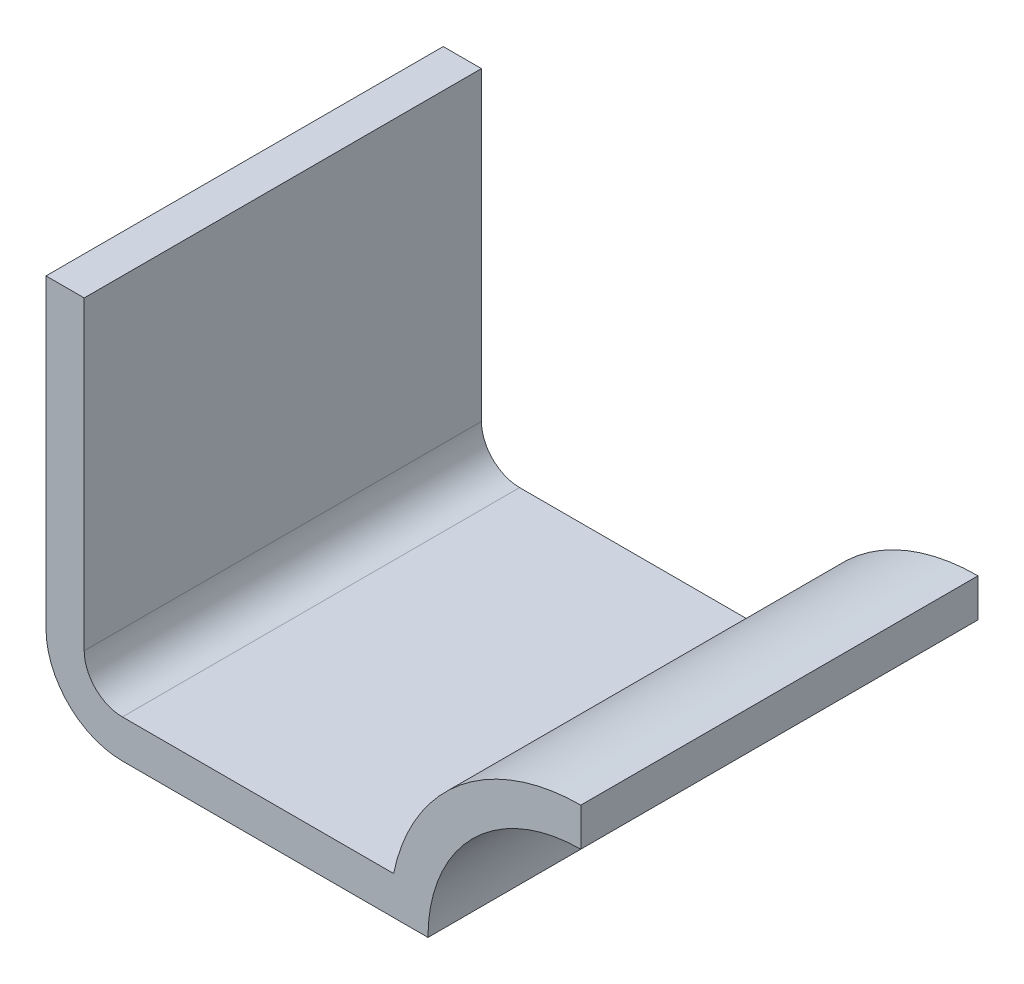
ISO-10303-21;
HEADER;
FILE_DESCRIPTION(('STEP AP214'),'2;1');
FILE_NAME('part.step','',(''),(''),'','','');
FILE_SCHEMA(('AUTOMOTIVE_DESIGN { 1 0 10303 214 1 1 1 1 }'));
ENDSEC;
DATA;
#1=APPLICATION_CONTEXT('core data for automotive mechanical design processes');
#2=APPLICATION_PROTOCOL_DEFINITION('international standard','automotive_design',2000,#1);
#3=PRODUCT_CONTEXT('',#1,'mechanical');
#4=PRODUCT('Part','Part','',(#3));
#5=PRODUCT_RELATED_PRODUCT_CATEGORY('part','',(#4));
#6=PRODUCT_DEFINITION_FORMATION('','',#4);
#7=PRODUCT_DEFINITION_CONTEXT('part definition',#1,'design');
#8=PRODUCT_DEFINITION('design','',#6,#7);
#9=PRODUCT_DEFINITION_SHAPE('','',#8);
#10=(LENGTH_UNIT() NAMED_UNIT(*) SI_UNIT(.MILLI.,.METRE.));
#11=(NAMED_UNIT(*) PLANE_ANGLE_UNIT() SI_UNIT($,.RADIAN.));
#12=(NAMED_UNIT(*) SI_UNIT($,.STERADIAN.) SOLID_ANGLE_UNIT());
#13=UNCERTAINTY_MEASURE_WITH_UNIT(LENGTH_MEASURE(1.E-05),#10,'distance_accuracy_value','');
#14=(GEOMETRIC_REPRESENTATION_CONTEXT(3) GLOBAL_UNCERTAINTY_ASSIGNED_CONTEXT((#13)) GLOBAL_UNIT_ASSIGNED_CONTEXT((#10,
#11,#12)) REPRESENTATION_CONTEXT('',''));
#15=CARTESIAN_POINT('',(0.,0.,0.));
#16=DIRECTION('',(0.,0.,1.));
#17=DIRECTION('',(1.,0.,0.));
#18=AXIS2_PLACEMENT_3D('',#15,#16,#17);
#19=CARTESIAN_POINT('',(5.,10.,26.));
#20=DIRECTION('',(-1.,0.,0.));
#21=DIRECTION('',(0.,0.,1.));
#22=AXIS2_PLACEMENT_3D('',#19,#20,#21);
#23=PLANE('',#22);
#24=DIRECTION('',(0.,1.,0.));
#25=VECTOR('',#24,1.);
#26=CARTESIAN_POINT('',(5.,10.,-26.));
#27=LINE('',#26,#25);
#28=CARTESIAN_POINT('',(5.,10.,-26.));
#29=VERTEX_POINT('',#28);
#30=CARTESIAN_POINT('',(5.,50.,-26.));
#31=VERTEX_POINT('',#30);
#32=EDGE_CURVE('E119',#29,#31,#27,.T.);
#33=ORIENTED_EDGE('',*,*,#32,.T.);
#34=DIRECTION('',(0.,0.,-1.));
#35=VECTOR('',#34,1.);
#36=CARTESIAN_POINT('',(5.,50.,26.));
#37=LINE('',#36,#35);
#38=CARTESIAN_POINT('',(5.,50.,26.));
#39=VERTEX_POINT('',#38);
#40=EDGE_CURVE('E11',#39,#31,#37,.T.);
#41=ORIENTED_EDGE('',*,*,#40,.F.);
#42=DIRECTION('',(0.,1.,0.));
#43=VECTOR('',#42,1.);
#44=CARTESIAN_POINT('',(5.,10.,26.));
#45=LINE('',#44,#43);
#46=CARTESIAN_POINT('',(5.,10.,26.));
#47=VERTEX_POINT('',#46);
#48=EDGE_CURVE('E148',#47,#39,#45,.T.);
#49=ORIENTED_EDGE('',*,*,#48,.F.);
#50=DIRECTION('',(0.,0.,-1.));
#51=VECTOR('',#50,1.);
#52=CARTESIAN_POINT('',(5.,10.,26.));
#53=LINE('',#52,#51);
#54=EDGE_CURVE('E120',#47,#29,#53,.T.);
#55=ORIENTED_EDGE('',*,*,#54,.T.);
#56=EDGE_LOOP('',(#33,#41,#49,#55));
#57=FACE_BOUND('',#56,.T.);
#58=ADVANCED_FACE('F33',(#57),#23,.F.);
#59=CARTESIAN_POINT('',(0.,50.,26.));
#60=DIRECTION('',(0.,1.,0.));
#61=DIRECTION('',(0.,0.,1.));
#62=AXIS2_PLACEMENT_3D('',#59,#60,#61);
#63=PLANE('',#62);
#64=DIRECTION('',(1.,0.,0.));
#65=VECTOR('',#64,1.);
#66=CARTESIAN_POINT('',(0.,50.,-26.));
#67=LINE('',#66,#65);
#68=CARTESIAN_POINT('',(0.,50.,-26.));
#69=VERTEX_POINT('',#68);
#70=EDGE_CURVE('E111',#69,#31,#67,.T.);
#71=ORIENTED_EDGE('',*,*,#70,.F.);
#72=DIRECTION('',(0.,0.,-1.));
#73=VECTOR('',#72,1.);
#74=CARTESIAN_POINT('',(0.,50.,26.));
#75=LINE('',#74,#73);
#76=CARTESIAN_POINT('',(0.,50.,26.));
#77=VERTEX_POINT('',#76);
#78=EDGE_CURVE('E40',#77,#69,#75,.T.);
#79=ORIENTED_EDGE('',*,*,#78,.F.);
#80=DIRECTION('',(1.,0.,0.));
#81=VECTOR('',#80,1.);
#82=CARTESIAN_POINT('',(0.,50.,26.));
#83=LINE('',#82,#81);
#84=EDGE_CURVE('E114',#77,#39,#83,.T.);
#85=ORIENTED_EDGE('',*,*,#84,.T.);
#86=ORIENTED_EDGE('',*,*,#40,.T.);
#87=EDGE_LOOP('',(#71,#79,#85,#86));
#88=FACE_BOUND('',#87,.T.);
#89=ADVANCED_FACE('F109',(#88),#63,.T.);
#90=CARTESIAN_POINT('',(0.,10.,26.));
#91=DIRECTION('',(-1.,0.,0.));
#92=DIRECTION('',(0.,0.,1.));
#93=AXIS2_PLACEMENT_3D('',#90,#91,#92);
#94=PLANE('',#93);
#95=DIRECTION('',(0.,1.,0.));
#96=VECTOR('',#95,1.);
#97=CARTESIAN_POINT('',(0.,10.,-26.));
#98=LINE('',#97,#96);
#99=CARTESIAN_POINT('',(0.,10.,-26.));
#100=VERTEX_POINT('',#99);
#101=EDGE_CURVE('E127',#100,#69,#98,.T.);
#102=ORIENTED_EDGE('',*,*,#101,.F.);
#103=DIRECTION('',(0.,0.,-1.));
#104=VECTOR('',#103,1.);
#105=CARTESIAN_POINT('',(0.,10.,26.));
#106=LINE('',#105,#104);
#107=CARTESIAN_POINT('',(0.,10.,26.));
#108=VERTEX_POINT('',#107);
#109=EDGE_CURVE('E185',#108,#100,#106,.T.);
#110=ORIENTED_EDGE('',*,*,#109,.F.);
#111=DIRECTION('',(0.,1.,0.));
#112=VECTOR('',#111,1.);
#113=CARTESIAN_POINT('',(0.,10.,26.));
#114=LINE('',#113,#112);
#115=EDGE_CURVE('E151',#108,#77,#114,.T.);
#116=ORIENTED_EDGE('',*,*,#115,.T.);
#117=ORIENTED_EDGE('',*,*,#78,.T.);
#118=EDGE_LOOP('',(#102,#110,#116,#117));
#119=FACE_BOUND('',#118,.T.);
#120=ADVANCED_FACE('F187',(#119),#94,.T.);
#121=CARTESIAN_POINT('',(10.,10.,26.));
#122=DIRECTION('',(0.,0.,-1.));
#123=DIRECTION('',(-1.,0.,0.));
#124=AXIS2_PLACEMENT_3D('',#121,#122,#123);
#125=CYLINDRICAL_SURFACE('',#124,10.);
#126=CARTESIAN_POINT('',(10.,10.,-26.));
#127=DIRECTION('',(0.,0.,-1.));
#128=DIRECTION('',(-1.,0.,0.));
#129=AXIS2_PLACEMENT_3D('',#126,#127,#128);
#130=CIRCLE('',#129,10.);
#131=CARTESIAN_POINT('',(10.,0.,-26.));
#132=VERTEX_POINT('',#131);
#133=EDGE_CURVE('E129',#132,#100,#130,.T.);
#134=ORIENTED_EDGE('',*,*,#133,.F.);
#135=DIRECTION('',(0.,0.,-1.));
#136=VECTOR('',#135,1.);
#137=CARTESIAN_POINT('',(10.,0.,26.));
#138=LINE('',#137,#136);
#139=CARTESIAN_POINT('',(10.,0.,26.));
#140=VERTEX_POINT('',#139);
#141=EDGE_CURVE('E183',#140,#132,#138,.T.);
#142=ORIENTED_EDGE('',*,*,#141,.F.);
#143=CARTESIAN_POINT('',(10.,10.,26.));
#144=DIRECTION('',(0.,0.,-1.));
#145=DIRECTION('',(-1.,0.,0.));
#146=AXIS2_PLACEMENT_3D('',#143,#144,#145);
#147=CIRCLE('',#146,10.);
#148=EDGE_CURVE('E154',#140,#108,#147,.T.);
#149=ORIENTED_EDGE('',*,*,#148,.T.);
#150=ORIENTED_EDGE('',*,*,#109,.T.);
#151=EDGE_LOOP('',(#134,#142,#149,#150));
#152=FACE_BOUND('',#151,.T.);
#153=ADVANCED_FACE('F194',(#152),#125,.T.);
#154=CARTESIAN_POINT('',(10.,0.,26.));
#155=DIRECTION('',(0.,-1.,0.));
#156=DIRECTION('',(0.,0.,-1.));
#157=AXIS2_PLACEMENT_3D('',#154,#155,#156);
#158=PLANE('',#157);
#159=DIRECTION('',(-1.,0.,0.));
#160=VECTOR('',#159,1.);
#161=CARTESIAN_POINT('',(10.,0.,-26.));
#162=LINE('',#161,#160);
#163=CARTESIAN_POINT('',(50.,0.,-26.));
#164=VERTEX_POINT('',#163);
#165=EDGE_CURVE('E133',#164,#132,#162,.T.);
#166=ORIENTED_EDGE('',*,*,#165,.F.);
#167=DIRECTION('',(0.,0.,-1.));
#168=VECTOR('',#167,1.);
#169=CARTESIAN_POINT('',(50.,0.,26.));
#170=LINE('',#169,#168);
#171=CARTESIAN_POINT('',(50.,0.,26.));
#172=VERTEX_POINT('',#171);
#173=EDGE_CURVE('E181',#172,#164,#170,.T.);
#174=ORIENTED_EDGE('',*,*,#173,.F.);
#175=DIRECTION('',(-1.,0.,0.));
#176=VECTOR('',#175,1.);
#177=CARTESIAN_POINT('',(10.,0.,26.));
#178=LINE('',#177,#176);
#179=EDGE_CURVE('E157',#172,#140,#178,.T.);
#180=ORIENTED_EDGE('',*,*,#179,.T.);
#181=ORIENTED_EDGE('',*,*,#141,.T.);
#182=EDGE_LOOP('',(#166,#174,#180,#181));
#183=FACE_BOUND('',#182,.T.);
#184=ADVANCED_FACE('F197',(#183),#158,.T.);
#185=CARTESIAN_POINT('',(70.,0.,26.));
#186=DIRECTION('',(0.,0.,-1.));
#187=DIRECTION('',(-1.,0.,0.));
#188=AXIS2_PLACEMENT_3D('',#185,#186,#187);
#189=CYLINDRICAL_SURFACE('',#188,20.);
#190=CARTESIAN_POINT('',(70.,0.,-26.));
#191=DIRECTION('',(0.,0.,1.));
#192=DIRECTION('',(-1.,0.,0.));
#193=AXIS2_PLACEMENT_3D('',#190,#191,#192);
#194=CIRCLE('',#193,20.);
#195=CARTESIAN_POINT('',(70.,20.,-26.));
#196=VERTEX_POINT('',#195);
#197=EDGE_CURVE('E136',#196,#164,#194,.T.);
#198=ORIENTED_EDGE('',*,*,#197,.F.);
#199=DIRECTION('',(0.,0.,-1.));
#200=VECTOR('',#199,1.);
#201=CARTESIAN_POINT('',(70.,20.,26.));
#202=LINE('',#201,#200);
#203=CARTESIAN_POINT('',(70.,20.,26.));
#204=VERTEX_POINT('',#203);
#205=EDGE_CURVE('E179',#204,#196,#202,.T.);
#206=ORIENTED_EDGE('',*,*,#205,.F.);
#207=CARTESIAN_POINT('',(70.,0.,26.));
#208=DIRECTION('',(0.,0.,1.));
#209=DIRECTION('',(-1.,0.,0.));
#210=AXIS2_PLACEMENT_3D('',#207,#208,#209);
#211=CIRCLE('',#210,20.);
#212=EDGE_CURVE('E160',#204,#172,#211,.T.);
#213=ORIENTED_EDGE('',*,*,#212,.T.);
#214=ORIENTED_EDGE('',*,*,#173,.T.);
#215=EDGE_LOOP('',(#198,#206,#213,#214));
#216=FACE_BOUND('',#215,.T.);
#217=ADVANCED_FACE('F202',(#216),#189,.F.);
#218=CARTESIAN_POINT('',(70.,25.,26.));
#219=DIRECTION('',(1.,0.,0.));
#220=DIRECTION('',(0.,0.,-1.));
#221=AXIS2_PLACEMENT_3D('',#218,#219,#220);
#222=PLANE('',#221);
#223=DIRECTION('',(0.,-1.,0.));
#224=VECTOR('',#223,1.);
#225=CARTESIAN_POINT('',(70.,25.,-26.));
#226=LINE('',#225,#224);
#227=CARTESIAN_POINT('',(70.,25.,-26.));
#228=VERTEX_POINT('',#227);
#229=EDGE_CURVE('E139',#228,#196,#226,.T.);
#230=ORIENTED_EDGE('',*,*,#229,.F.);
#231=DIRECTION('',(0.,0.,-1.));
#232=VECTOR('',#231,1.);
#233=CARTESIAN_POINT('',(70.,25.,26.));
#234=LINE('',#233,#232);
#235=CARTESIAN_POINT('',(70.,25.,26.));
#236=VERTEX_POINT('',#235);
#237=EDGE_CURVE('E177',#236,#228,#234,.T.);
#238=ORIENTED_EDGE('',*,*,#237,.F.);
#239=DIRECTION('',(0.,-1.,0.));
#240=VECTOR('',#239,1.);
#241=CARTESIAN_POINT('',(70.,25.,26.));
#242=LINE('',#241,#240);
#243=EDGE_CURVE('E163',#236,#204,#242,.T.);
#244=ORIENTED_EDGE('',*,*,#243,.T.);
#245=ORIENTED_EDGE('',*,*,#205,.T.);
#246=EDGE_LOOP('',(#230,#238,#244,#245));
#247=FACE_BOUND('',#246,.T.);
#248=ADVANCED_FACE('F205',(#247),#222,.T.);
#249=CARTESIAN_POINT('',(70.,0.,26.));
#250=DIRECTION('',(0.,0.,-1.));
#251=DIRECTION('',(-1.,0.,0.));
#252=AXIS2_PLACEMENT_3D('',#249,#250,#251);
#253=CYLINDRICAL_SURFACE('',#252,25.);
#254=CARTESIAN_POINT('',(70.,0.,-26.));
#255=DIRECTION('',(0.,0.,1.));
#256=DIRECTION('',(1.,0.,0.));
#257=AXIS2_PLACEMENT_3D('',#254,#255,#256);
#258=CIRCLE('',#257,25.);
#259=CARTESIAN_POINT('',(45.5051025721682,5.,-26.));
#260=VERTEX_POINT('',#259);
#261=EDGE_CURVE('E142',#228,#260,#258,.T.);
#262=ORIENTED_EDGE('',*,*,#261,.T.);
#263=DIRECTION('',(0.,0.,-1.));
#264=VECTOR('',#263,1.);
#265=CARTESIAN_POINT('',(45.5051025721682,5.,26.));
#266=LINE('',#265,#264);
#267=CARTESIAN_POINT('',(45.5051025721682,5.,26.));
#268=VERTEX_POINT('',#267);
#269=EDGE_CURVE('E174',#268,#260,#266,.T.);
#270=ORIENTED_EDGE('',*,*,#269,.F.);
#271=CARTESIAN_POINT('',(70.,0.,26.));
#272=DIRECTION('',(0.,0.,1.));
#273=DIRECTION('',(1.,0.,0.));
#274=AXIS2_PLACEMENT_3D('',#271,#272,#273);
#275=CIRCLE('',#274,25.);
#276=EDGE_CURVE('E166',#236,#268,#275,.T.);
#277=ORIENTED_EDGE('',*,*,#276,.F.);
#278=ORIENTED_EDGE('',*,*,#237,.T.);
#279=EDGE_LOOP('',(#262,#270,#277,#278));
#280=FACE_BOUND('',#279,.T.);
#281=ADVANCED_FACE('F209',(#280),#253,.T.);
#282=CARTESIAN_POINT('',(10.,5.,26.));
#283=DIRECTION('',(0.,-1.,0.));
#284=DIRECTION('',(0.,0.,-1.));
#285=AXIS2_PLACEMENT_3D('',#282,#283,#284);
#286=PLANE('',#285);
#287=DIRECTION('',(1.,0.,0.));
#288=VECTOR('',#287,1.);
#289=CARTESIAN_POINT('',(10.,5.,-26.));
#290=LINE('',#289,#288);
#291=CARTESIAN_POINT('',(10.,5.,-26.));
#292=VERTEX_POINT('',#291);
#293=EDGE_CURVE('E144',#260,#292,#290,.F.);
#294=ORIENTED_EDGE('',*,*,#293,.T.);
#295=DIRECTION('',(0.,0.,-1.));
#296=VECTOR('',#295,1.);
#297=CARTESIAN_POINT('',(10.,5.,26.));
#298=LINE('',#297,#296);
#299=CARTESIAN_POINT('',(10.,5.,26.));
#300=VERTEX_POINT('',#299);
#301=EDGE_CURVE('E171',#300,#292,#298,.T.);
#302=ORIENTED_EDGE('',*,*,#301,.F.);
#303=DIRECTION('',(1.,0.,0.));
#304=VECTOR('',#303,1.);
#305=CARTESIAN_POINT('',(10.,5.,26.));
#306=LINE('',#305,#304);
#307=EDGE_CURVE('E52',#268,#300,#306,.F.);
#308=ORIENTED_EDGE('',*,*,#307,.F.);
#309=ORIENTED_EDGE('',*,*,#269,.T.);
#310=EDGE_LOOP('',(#294,#302,#308,#309));
#311=FACE_BOUND('',#310,.T.);
#312=ADVANCED_FACE('F213',(#311),#286,.F.);
#313=CARTESIAN_POINT('',(10.,10.,26.));
#314=DIRECTION('',(0.,0.,-1.));
#315=DIRECTION('',(-1.,0.,0.));
#316=AXIS2_PLACEMENT_3D('',#313,#314,#315);
#317=CYLINDRICAL_SURFACE('',#316,5.);
#318=CARTESIAN_POINT('',(10.,10.,-26.));
#319=DIRECTION('',(0.,0.,1.));
#320=DIRECTION('',(1.,0.,0.));
#321=AXIS2_PLACEMENT_3D('',#318,#319,#320);
#322=CIRCLE('',#321,5.);
#323=EDGE_CURVE('E146',#292,#29,#322,.F.);
#324=ORIENTED_EDGE('',*,*,#323,.T.);
#325=ORIENTED_EDGE('',*,*,#54,.F.);
#326=CARTESIAN_POINT('',(10.,10.,26.));
#327=DIRECTION('',(0.,0.,1.));
#328=DIRECTION('',(1.,0.,0.));
#329=AXIS2_PLACEMENT_3D('',#326,#327,#328);
#330=CIRCLE('',#329,5.);
#331=EDGE_CURVE('E47',#300,#47,#330,.F.);
#332=ORIENTED_EDGE('',*,*,#331,.F.);
#333=ORIENTED_EDGE('',*,*,#301,.T.);
#334=EDGE_LOOP('',(#324,#325,#332,#333));
#335=FACE_BOUND('',#334,.T.);
#336=ADVANCED_FACE('F215',(#335),#317,.F.);
#337=CARTESIAN_POINT('',(10.,10.,26.));
#338=DIRECTION('',(0.,0.,-1.));
#339=DIRECTION('',(-1.,0.,0.));
#340=AXIS2_PLACEMENT_3D('',#337,#338,#339);
#341=PLANE('',#340);
#342=ORIENTED_EDGE('',*,*,#48,.T.);
#343=ORIENTED_EDGE('',*,*,#84,.F.);
#344=ORIENTED_EDGE('',*,*,#115,.F.);
#345=ORIENTED_EDGE('',*,*,#148,.F.);
#346=ORIENTED_EDGE('',*,*,#179,.F.);
#347=ORIENTED_EDGE('',*,*,#212,.F.);
#348=ORIENTED_EDGE('',*,*,#243,.F.);
#349=ORIENTED_EDGE('',*,*,#276,.T.);
#350=ORIENTED_EDGE('',*,*,#307,.T.);
#351=ORIENTED_EDGE('',*,*,#331,.T.);
#352=EDGE_LOOP('',(#342,#343,#344,#345,#346,#347,#348,#349,#350,#351));
#353=FACE_BOUND('',#352,.T.);
#354=ADVANCED_FACE('F189',(#353),#341,.F.);
#355=CARTESIAN_POINT('',(10.,10.,-26.));
#356=DIRECTION('',(0.,0.,-1.));
#357=DIRECTION('',(-1.,0.,0.));
#358=AXIS2_PLACEMENT_3D('',#355,#356,#357);
#359=PLANE('',#358);
#360=ORIENTED_EDGE('',*,*,#32,.F.);
#361=ORIENTED_EDGE('',*,*,#323,.F.);
#362=ORIENTED_EDGE('',*,*,#293,.F.);
#363=ORIENTED_EDGE('',*,*,#261,.F.);
#364=ORIENTED_EDGE('',*,*,#229,.T.);
#365=ORIENTED_EDGE('',*,*,#197,.T.);
#366=ORIENTED_EDGE('',*,*,#165,.T.);
#367=ORIENTED_EDGE('',*,*,#133,.T.);
#368=ORIENTED_EDGE('',*,*,#101,.T.);
#369=ORIENTED_EDGE('',*,*,#70,.T.);
#370=EDGE_LOOP('',(#360,#361,#362,#363,#364,#365,#366,#367,#368,#369));
#371=FACE_BOUND('',#370,.T.);
#372=ADVANCED_FACE('F124',(#371),#359,.T.);
#373=CLOSED_SHELL('',(#58,#89,#120,#153,#184,#217,#248,#281,#312,#336,#354,#372));
#374=MANIFOLD_SOLID_BREP('B2',#373);
#375=ADVANCED_BREP_SHAPE_REPRESENTATION('',(#18,#374),#14);
#376=SHAPE_DEFINITION_REPRESENTATION(#9,#375);
ENDSEC;
END-ISO-10303-21;
